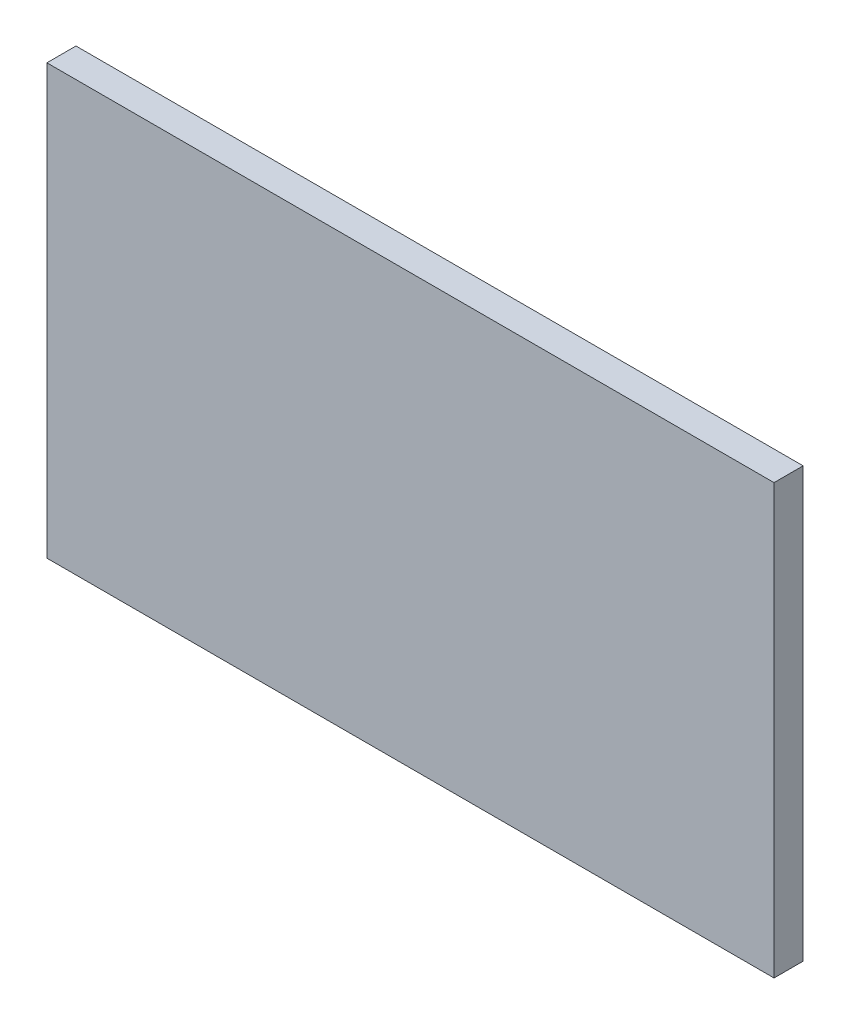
ISO-10303-21;
HEADER;
FILE_DESCRIPTION(('STEP AP214'),'2;1');
FILE_NAME('part.step','',(''),(''),'','','');
FILE_SCHEMA(('AUTOMOTIVE_DESIGN { 1 0 10303 214 1 1 1 1 }'));
ENDSEC;
DATA;
#1=APPLICATION_CONTEXT('core data for automotive mechanical design processes');
#2=APPLICATION_PROTOCOL_DEFINITION('international standard','automotive_design',2000,#1);
#3=PRODUCT_CONTEXT('',#1,'mechanical');
#4=PRODUCT('Part','Part','',(#3));
#5=PRODUCT_RELATED_PRODUCT_CATEGORY('part','',(#4));
#6=PRODUCT_DEFINITION_FORMATION('','',#4);
#7=PRODUCT_DEFINITION_CONTEXT('part definition',#1,'design');
#8=PRODUCT_DEFINITION('design','',#6,#7);
#9=PRODUCT_DEFINITION_SHAPE('','',#8);
#10=(LENGTH_UNIT() NAMED_UNIT(*) SI_UNIT(.MILLI.,.METRE.));
#11=(NAMED_UNIT(*) PLANE_ANGLE_UNIT() SI_UNIT($,.RADIAN.));
#12=(NAMED_UNIT(*) SI_UNIT($,.STERADIAN.) SOLID_ANGLE_UNIT());
#13=UNCERTAINTY_MEASURE_WITH_UNIT(LENGTH_MEASURE(1.E-05),#10,'distance_accuracy_value','');
#14=(GEOMETRIC_REPRESENTATION_CONTEXT(3) GLOBAL_UNCERTAINTY_ASSIGNED_CONTEXT((#13)) GLOBAL_UNIT_ASSIGNED_CONTEXT((#10,
#11,#12)) REPRESENTATION_CONTEXT('',''));
#15=CARTESIAN_POINT('',(0.,0.,0.));
#16=DIRECTION('',(0.,0.,1.));
#17=DIRECTION('',(1.,0.,0.));
#18=AXIS2_PLACEMENT_3D('',#15,#16,#17);
#19=CARTESIAN_POINT('',(0.,0.,1.016));
#20=DIRECTION('',(-1.,0.,0.));
#21=DIRECTION('',(0.,-1.,0.));
#22=AXIS2_PLACEMENT_3D('',#19,#20,#21);
#23=PLANE('',#22);
#24=DIRECTION('',(0.,1.,0.));
#25=VECTOR('',#24,1.);
#26=CARTESIAN_POINT('',(0.,0.,0.));
#27=LINE('',#26,#25);
#28=CARTESIAN_POINT('',(0.,-14.986,0.));
#29=VERTEX_POINT('',#28);
#30=CARTESIAN_POINT('',(0.,0.,0.));
#31=VERTEX_POINT('',#30);
#32=EDGE_CURVE('E101',#29,#31,#27,.T.);
#33=ORIENTED_EDGE('',*,*,#32,.T.);
#34=DIRECTION('',(0.,0.,-1.));
#35=VECTOR('',#34,1.);
#36=CARTESIAN_POINT('',(0.,0.,1.016));
#37=LINE('',#36,#35);
#38=CARTESIAN_POINT('',(0.,0.,1.016));
#39=VERTEX_POINT('',#38);
#40=EDGE_CURVE('E11',#39,#31,#37,.T.);
#41=ORIENTED_EDGE('',*,*,#40,.F.);
#42=DIRECTION('',(0.,1.,0.));
#43=VECTOR('',#42,1.);
#44=CARTESIAN_POINT('',(0.,0.,1.016));
#45=LINE('',#44,#43);
#46=CARTESIAN_POINT('',(0.,-14.986,1.016));
#47=VERTEX_POINT('',#46);
#48=EDGE_CURVE('E89',#47,#39,#45,.T.);
#49=ORIENTED_EDGE('',*,*,#48,.F.);
#50=DIRECTION('',(0.,0.,-1.));
#51=VECTOR('',#50,1.);
#52=CARTESIAN_POINT('',(0.,-14.986,1.016));
#53=LINE('',#52,#51);
#54=EDGE_CURVE('E97',#47,#29,#53,.T.);
#55=ORIENTED_EDGE('',*,*,#54,.T.);
#56=EDGE_LOOP('',(#33,#41,#49,#55));
#57=FACE_BOUND('',#56,.T.);
#58=ADVANCED_FACE('F38',(#57),#23,.F.);
#59=CARTESIAN_POINT('',(0.,0.,1.016));
#60=DIRECTION('',(0.,-1.,0.));
#61=DIRECTION('',(1.,0.,0.));
#62=AXIS2_PLACEMENT_3D('',#59,#60,#61);
#63=PLANE('',#62);
#64=DIRECTION('',(-1.,0.,0.));
#65=VECTOR('',#64,1.);
#66=CARTESIAN_POINT('',(0.,0.,0.));
#67=LINE('',#66,#65);
#68=CARTESIAN_POINT('',(-25.4,0.,0.));
#69=VERTEX_POINT('',#68);
#70=EDGE_CURVE('E93',#31,#69,#67,.T.);
#71=ORIENTED_EDGE('',*,*,#70,.T.);
#72=DIRECTION('',(0.,0.,-1.));
#73=VECTOR('',#72,1.);
#74=CARTESIAN_POINT('',(-25.4,0.,1.016));
#75=LINE('',#74,#73);
#76=CARTESIAN_POINT('',(-25.4,0.,1.016));
#77=VERTEX_POINT('',#76);
#78=EDGE_CURVE('E46',#77,#69,#75,.T.);
#79=ORIENTED_EDGE('',*,*,#78,.F.);
#80=DIRECTION('',(-1.,0.,0.));
#81=VECTOR('',#80,1.);
#82=CARTESIAN_POINT('',(0.,0.,1.016));
#83=LINE('',#82,#81);
#84=EDGE_CURVE('E84',#39,#77,#83,.T.);
#85=ORIENTED_EDGE('',*,*,#84,.F.);
#86=ORIENTED_EDGE('',*,*,#40,.T.);
#87=EDGE_LOOP('',(#71,#79,#85,#86));
#88=FACE_BOUND('',#87,.T.);
#89=ADVANCED_FACE('F92',(#88),#63,.F.);
#90=CARTESIAN_POINT('',(-25.4,0.,1.016));
#91=DIRECTION('',(1.,0.,0.));
#92=DIRECTION('',(0.,1.,0.));
#93=AXIS2_PLACEMENT_3D('',#90,#91,#92);
#94=PLANE('',#93);
#95=DIRECTION('',(0.,-1.,0.));
#96=VECTOR('',#95,1.);
#97=CARTESIAN_POINT('',(-25.4,0.,0.));
#98=LINE('',#97,#96);
#99=CARTESIAN_POINT('',(-25.4,-14.986,0.));
#100=VERTEX_POINT('',#99);
#101=EDGE_CURVE('E71',#69,#100,#98,.T.);
#102=ORIENTED_EDGE('',*,*,#101,.T.);
#103=DIRECTION('',(0.,0.,-1.));
#104=VECTOR('',#103,1.);
#105=CARTESIAN_POINT('',(-25.4,-14.986,1.016));
#106=LINE('',#105,#104);
#107=CARTESIAN_POINT('',(-25.4,-14.986,1.016));
#108=VERTEX_POINT('',#107);
#109=EDGE_CURVE('E94',#108,#100,#106,.T.);
#110=ORIENTED_EDGE('',*,*,#109,.F.);
#111=DIRECTION('',(0.,-1.,0.));
#112=VECTOR('',#111,1.);
#113=CARTESIAN_POINT('',(-25.4,0.,1.016));
#114=LINE('',#113,#112);
#115=EDGE_CURVE('E87',#77,#108,#114,.T.);
#116=ORIENTED_EDGE('',*,*,#115,.F.);
#117=ORIENTED_EDGE('',*,*,#78,.T.);
#118=EDGE_LOOP('',(#102,#110,#116,#117));
#119=FACE_BOUND('',#118,.T.);
#120=ADVANCED_FACE('F95',(#119),#94,.F.);
#121=CARTESIAN_POINT('',(0.,-14.986,1.016));
#122=DIRECTION('',(0.,1.,0.));
#123=DIRECTION('',(0.,0.,1.));
#124=AXIS2_PLACEMENT_3D('',#121,#122,#123);
#125=PLANE('',#124);
#126=DIRECTION('',(1.,0.,0.));
#127=VECTOR('',#126,1.);
#128=CARTESIAN_POINT('',(0.,-14.986,0.));
#129=LINE('',#128,#127);
#130=EDGE_CURVE('E77',#100,#29,#129,.T.);
#131=ORIENTED_EDGE('',*,*,#130,.T.);
#132=ORIENTED_EDGE('',*,*,#54,.F.);
#133=DIRECTION('',(1.,0.,0.));
#134=VECTOR('',#133,1.);
#135=CARTESIAN_POINT('',(0.,-14.986,1.016));
#136=LINE('',#135,#134);
#137=EDGE_CURVE('E54',#108,#47,#136,.T.);
#138=ORIENTED_EDGE('',*,*,#137,.F.);
#139=ORIENTED_EDGE('',*,*,#109,.T.);
#140=EDGE_LOOP('',(#131,#132,#138,#139));
#141=FACE_BOUND('',#140,.T.);
#142=ADVANCED_FACE('F108',(#141),#125,.F.);
#143=CARTESIAN_POINT('',(0.,0.,1.016));
#144=DIRECTION('',(0.,0.,-1.));
#145=DIRECTION('',(-1.,0.,0.));
#146=AXIS2_PLACEMENT_3D('',#143,#144,#145);
#147=PLANE('',#146);
#148=ORIENTED_EDGE('',*,*,#48,.T.);
#149=ORIENTED_EDGE('',*,*,#84,.T.);
#150=ORIENTED_EDGE('',*,*,#115,.T.);
#151=ORIENTED_EDGE('',*,*,#137,.T.);
#152=EDGE_LOOP('',(#148,#149,#150,#151));
#153=FACE_BOUND('',#152,.T.);
#154=ADVANCED_FACE('F85',(#153),#147,.F.);
#155=CARTESIAN_POINT('',(0.,0.,0.));
#156=DIRECTION('',(0.,0.,-1.));
#157=DIRECTION('',(-1.,0.,0.));
#158=AXIS2_PLACEMENT_3D('',#155,#156,#157);
#159=PLANE('',#158);
#160=ORIENTED_EDGE('',*,*,#32,.F.);
#161=ORIENTED_EDGE('',*,*,#130,.F.);
#162=ORIENTED_EDGE('',*,*,#101,.F.);
#163=ORIENTED_EDGE('',*,*,#70,.F.);
#164=EDGE_LOOP('',(#160,#161,#162,#163));
#165=FACE_BOUND('',#164,.T.);
#166=ADVANCED_FACE('F111',(#165),#159,.T.);
#167=CLOSED_SHELL('',(#58,#89,#120,#142,#154,#166));
#168=MANIFOLD_SOLID_BREP('B2',#167);
#169=ADVANCED_BREP_SHAPE_REPRESENTATION('',(#18,#168),#14);
#170=SHAPE_DEFINITION_REPRESENTATION(#9,#169);
ENDSEC;
END-ISO-10303-21;
